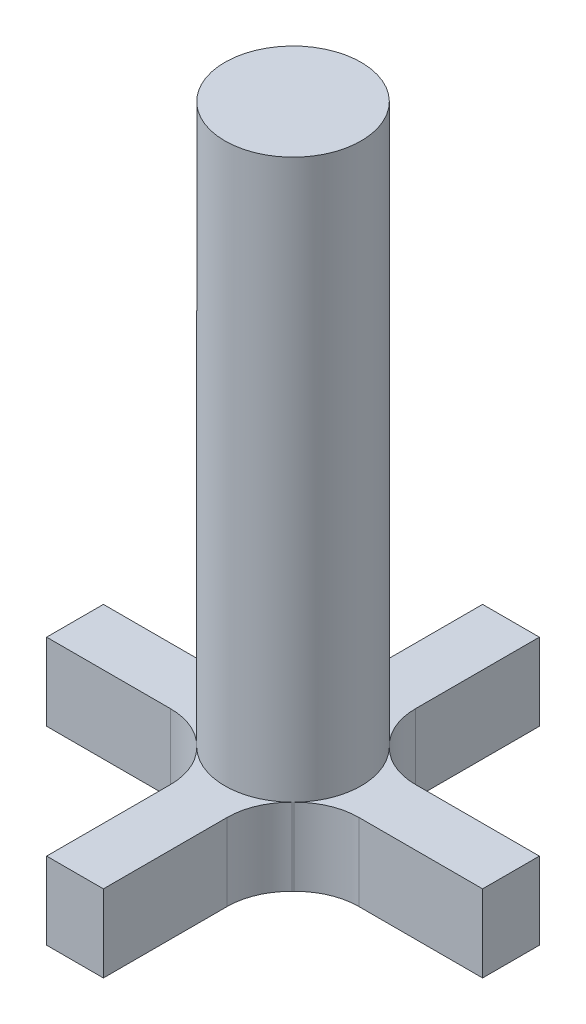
from build123d import *

# Parameters (mm, degrees)
SKETCH2_R           = 3.81
BOSS_EXTRUDE1_DEPTH = 35.56
BOSS_EXTRUDE2_DEPTH = 4.318
FILLET1_R           = 3.556


with BuildPart() as part:
    # Sketch2 → Boss-Extrude1 (new body)
    with BuildSketch(Plane(origin=(0, 0, 0), x_dir=(1, 0, 0), z_dir=(0, 1, 0))):
        with Locations(Location((0, 0, 0), (0, 0, 270))):
            Circle(SKETCH2_R)
    extrude(amount=BOSS_EXTRUDE1_DEPTH)

    # Sketch3 → Boss-Extrude2 (add)
    with BuildSketch(Plane.XZ):
        with BuildLine():
            Line((-1.5875, 12.192), (-1.5875, 3.463516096))
            ThreePointArc((-1.5875, 3.463516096), (0, 3.81), (1.5875, 3.463516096))
            Line((1.5875, 3.463516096), (1.5875, 12.192))
            Line((1.5875, 12.192), (-1.5875, 12.192))
        make_face()
        with BuildLine():
            Line((12.192, 1.5875), (3.463516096, 1.5875))
            ThreePointArc((3.463516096, 1.5875), (3.722371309, 0.812435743), (3.81, 0))
            ThreePointArc((3.81, 0), (3.722371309, -0.812435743), (3.463516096, -1.5875))
            Line((3.463516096, -1.5875), (12.192, -1.5875))
            Line((12.192, -1.5875), (12.192, 1.5875))
        make_face()
        with BuildLine():
            Line((-3.463516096, 1.5875), (-12.192, 1.5875))
            Line((-12.192, 1.5875), (-12.192, -1.5875))
            Line((-12.192, -1.5875), (-3.463516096, -1.5875))
            ThreePointArc((-3.463516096, -1.5875), (-3.81, 0), (-3.463516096, 1.5875))
        make_face()
        with BuildLine():
            ThreePointArc((1.5875, -3.463516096), (0, -3.81), (-1.5875, -3.463516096))
            Line((-1.5875, -3.463516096), (-1.5875, -12.192))
            Line((-1.5875, -12.192), (1.5875, -12.192))
            Line((1.5875, -12.192), (1.5875, -3.463516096))
        make_face()
    extrude(amount=-BOSS_EXTRUDE2_DEPTH)

    # Fillet1
    fillet1_edges = [part.edges().sort_by_distance(p)[0] for p in [
        (3.463516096, 2.159, -1.5875),
        (3.463516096, 2.159, 1.5875),
        (-3.463516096, 2.159, 1.5875),
        (-3.463516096, 2.159, -1.5875),
        (1.5875, 2.159, -3.463516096),
        (-1.5875, 2.159, -3.463516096),
        (1.5875, 2.159, 3.463516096),
        (-1.5875, 2.159, 3.463516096),
    ]]
    fillet(fillet1_edges, radius=FILLET1_R)


solid = part.part
